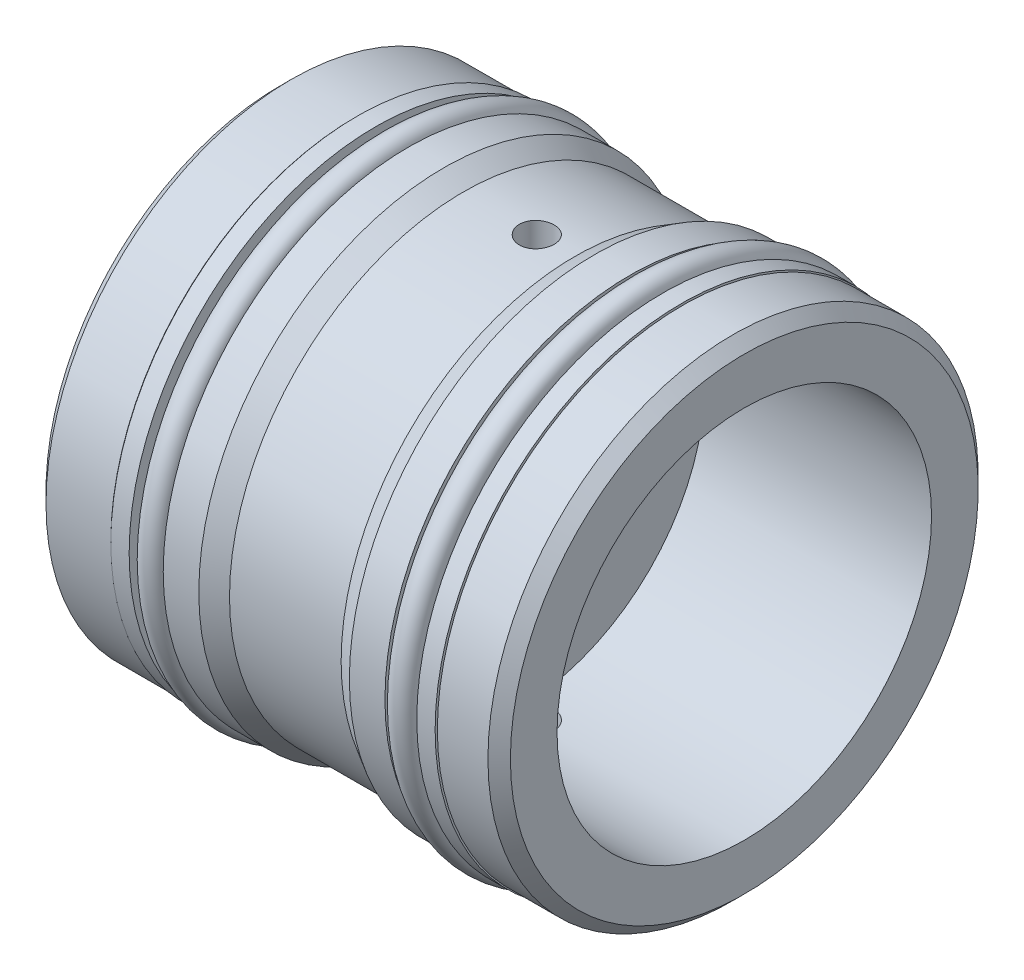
from build123d import *

# Parameters (mm, degrees)
FILLET1_R               = 0.381
CHAMFER1_SIZE           = 0.762
SKETCH6_R               = 0.889
SKETCH6_W               = 1.2446
SKETCH6_H               = 1.3462
CUT_EXTRUDE1_DEPTH      = 29.806606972
CUT_EXTRUDE1_DEPTH_BACK = 29.806606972
SKETCH7_R               = 1.1811


with BuildPart() as part:
    # Sketch1 → Revolve1 (revolve)
    with BuildSketch(Plane.XY, mode=Mode.PRIVATE) as revolve1_sk:
        Polygon((-15.748, 6.35), (-15.748, 16.6243), (-10.5918, 16.6243), (-10.5918, 15.3543), (-7.0358, 15.3543), (-7.0358, 16.6243), (-4.6228, 16.6243), (-4.6228, 15.8623), (5.588, 15.8623), (5.588, 16.6243), (8.001, 16.6243), (8.001, 15.3543), (11.557, 15.3543), (11.557, 16.6243), (15.748, 16.6243), (15.748, 12.7), (0.3556, 12.7), (0.3556, 6.35), align=None)
    revolve(revolve1_sk.sketch.rotate(Axis((0, 0, 0), (1, 0, 0)), 90), axis=Axis((0, 0, 0), (1, 0, 0)))

    # Fillet1
    fillet1_edges = [part.edges().sort_by_distance(p)[0] for p in [
        (-4.6228, 0, -15.8623),
        (5.588, 0, -15.8623),
    ]]
    fillet(fillet1_edges, radius=FILLET1_R)

    # Chamfer1
    chamfer1_edges = [part.edges().sort_by_distance(p)[0] for p in [
        (-15.748, 0, -16.6243),
        (15.748, 0, -16.6243),
    ]]
    chamfer(chamfer1_edges, length=CHAMFER1_SIZE)

    # Sketch6 → Revolve3 (revolve)
    with BuildSketch(Plane.XY, mode=Mode.PRIVATE) as revolve3_sk:
        with Locations((-8.001, 16.1671)):
            Circle(SKETCH6_R)
        with Locations((8.9662, 16.1671)):
            Circle(SKETCH6_R)
        with Locations((-9.8933, 16.0274)):
            Rectangle(SKETCH6_W, SKETCH6_H)
        with Locations((10.8585, 16.0274)):
            Rectangle(SKETCH6_W, SKETCH6_H)
    revolve(revolve3_sk.sketch.rotate(Axis((0, 0, 0), (1, 0, 0)), 90), axis=Axis((0, 0, 0), (1, 0, 0)))

    # Sketch7 → Cut-Extrude1 (cut, two sides: drawn at the far end of the back side and taken through both)
    with BuildSketch(Plane(origin=(0, 0, 0), x_dir=(0, 0, -1), z_dir=(0, 1, 0)).offset(-CUT_EXTRUDE1_DEPTH_BACK)):
        with Locations(Location((0, -1.6764, 0), (0, 0, 180))):
            Circle(SKETCH7_R)
    extrude(amount=CUT_EXTRUDE1_DEPTH + CUT_EXTRUDE1_DEPTH_BACK, mode=Mode.SUBTRACT)

    # Sketch8 → Revolve4 (revolve)
    with BuildSketch(Plane.XY, mode=Mode.PRIVATE) as revolve4_sk:
        Polygon((-4.6228, 16.6243), (-3.302977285, 15.8623), (-4.6228, 15.8623), align=None)
        Polygon((5.588, 15.8623), (5.588, 16.6243), (4.268177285, 15.8623), align=None)
    revolve(revolve4_sk.sketch.rotate(Axis((0, 0, 0), (1, 0, 0)), 90), axis=Axis((0, 0, 0), (1, 0, 0)))


solid = part.part
